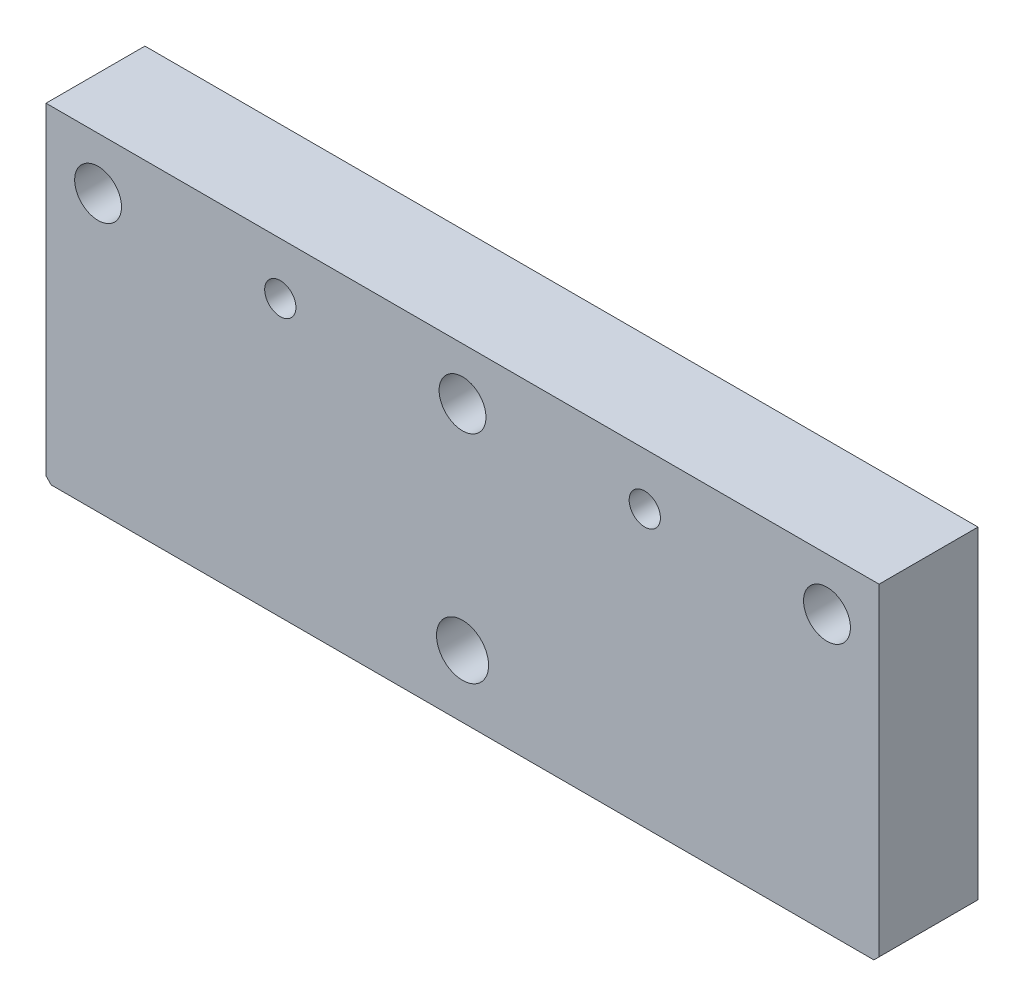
ISO-10303-21;
HEADER;
FILE_DESCRIPTION(('STEP AP214'),'2;1');
FILE_NAME('part.step','',(''),(''),'','','');
FILE_SCHEMA(('AUTOMOTIVE_DESIGN { 1 0 10303 214 1 1 1 1 }'));
ENDSEC;
DATA;
#1=APPLICATION_CONTEXT('core data for automotive mechanical design processes');
#2=APPLICATION_PROTOCOL_DEFINITION('international standard','automotive_design',2000,#1);
#3=PRODUCT_CONTEXT('',#1,'mechanical');
#4=PRODUCT('Part','Part','',(#3));
#5=PRODUCT_RELATED_PRODUCT_CATEGORY('part','',(#4));
#6=PRODUCT_DEFINITION_FORMATION('','',#4);
#7=PRODUCT_DEFINITION_CONTEXT('part definition',#1,'design');
#8=PRODUCT_DEFINITION('design','',#6,#7);
#9=PRODUCT_DEFINITION_SHAPE('','',#8);
#10=(LENGTH_UNIT() NAMED_UNIT(*) SI_UNIT(.MILLI.,.METRE.));
#11=(NAMED_UNIT(*) PLANE_ANGLE_UNIT() SI_UNIT($,.RADIAN.));
#12=(NAMED_UNIT(*) SI_UNIT($,.STERADIAN.) SOLID_ANGLE_UNIT());
#13=UNCERTAINTY_MEASURE_WITH_UNIT(LENGTH_MEASURE(1.E-05),#10,'distance_accuracy_value','');
#14=(GEOMETRIC_REPRESENTATION_CONTEXT(3) GLOBAL_UNCERTAINTY_ASSIGNED_CONTEXT((#13)) GLOBAL_UNIT_ASSIGNED_CONTEXT((#10,
#11,#12)) REPRESENTATION_CONTEXT('',''));
#15=CARTESIAN_POINT('',(0.,0.,0.));
#16=DIRECTION('',(0.,0.,1.));
#17=DIRECTION('',(1.,0.,0.));
#18=AXIS2_PLACEMENT_3D('',#15,#16,#17);
#19=CARTESIAN_POINT('',(35.,10.75,0.));
#20=DIRECTION('',(0.,0.,-1.));
#21=DIRECTION('',(-1.,0.,0.));
#22=AXIS2_PLACEMENT_3D('',#19,#20,#21);
#23=CYLINDRICAL_SURFACE('',#22,3.99999999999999);
#24=CARTESIAN_POINT('',(35.,10.75,4.4));
#25=DIRECTION('',(0.,0.,-1.));
#26=DIRECTION('',(-1.,0.,0.));
#27=AXIS2_PLACEMENT_3D('',#24,#25,#26);
#28=CIRCLE('',#27,3.99999999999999);
#29=CARTESIAN_POINT('',(31.,10.75,4.4));
#30=VERTEX_POINT('',#29);
#31=EDGE_CURVE('E19',#30,#30,#28,.F.);
#32=ORIENTED_EDGE('',*,*,#31,.T.);
#33=EDGE_LOOP('',(#32));
#34=FACE_BOUND('',#33,.T.);
#35=CARTESIAN_POINT('',(35.,10.75,0.));
#36=DIRECTION('',(0.,0.,-1.));
#37=DIRECTION('',(-1.,0.,0.));
#38=AXIS2_PLACEMENT_3D('',#35,#36,#37);
#39=CIRCLE('',#38,3.99999999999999);
#40=CARTESIAN_POINT('',(31.,10.75,0.));
#41=VERTEX_POINT('',#40);
#42=EDGE_CURVE('E162',#41,#41,#39,.T.);
#43=ORIENTED_EDGE('',*,*,#42,.T.);
#44=EDGE_LOOP('',(#43));
#45=FACE_BOUND('',#44,.T.);
#46=ADVANCED_FACE('F16',(#34,#45),#23,.F.);
#47=CARTESIAN_POINT('',(0.,10.75,0.));
#48=DIRECTION('',(0.,0.,-1.));
#49=DIRECTION('',(-1.,0.,0.));
#50=AXIS2_PLACEMENT_3D('',#47,#48,#49);
#51=CYLINDRICAL_SURFACE('',#50,3.99999999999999);
#52=CARTESIAN_POINT('',(0.,10.75,4.4));
#53=DIRECTION('',(0.,0.,-1.));
#54=DIRECTION('',(-1.,0.,0.));
#55=AXIS2_PLACEMENT_3D('',#52,#53,#54);
#56=CIRCLE('',#55,3.99999999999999);
#57=CARTESIAN_POINT('',(-3.99999999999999,10.75,4.4));
#58=VERTEX_POINT('',#57);
#59=EDGE_CURVE('E167',#58,#58,#56,.F.);
#60=ORIENTED_EDGE('',*,*,#59,.T.);
#61=EDGE_LOOP('',(#60));
#62=FACE_BOUND('',#61,.T.);
#63=CARTESIAN_POINT('',(0.,10.75,0.));
#64=DIRECTION('',(0.,0.,-1.));
#65=DIRECTION('',(-1.,0.,0.));
#66=AXIS2_PLACEMENT_3D('',#63,#64,#65);
#67=CIRCLE('',#66,3.99999999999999);
#68=CARTESIAN_POINT('',(-3.99999999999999,10.75,0.));
#69=VERTEX_POINT('',#68);
#70=EDGE_CURVE('E159',#69,#69,#67,.T.);
#71=ORIENTED_EDGE('',*,*,#70,.T.);
#72=EDGE_LOOP('',(#71));
#73=FACE_BOUND('',#72,.T.);
#74=ADVANCED_FACE('F233',(#62,#73),#51,.F.);
#75=CARTESIAN_POINT('',(-35.,10.75,0.));
#76=DIRECTION('',(0.,0.,-1.));
#77=DIRECTION('',(-1.,0.,0.));
#78=AXIS2_PLACEMENT_3D('',#75,#76,#77);
#79=CYLINDRICAL_SURFACE('',#78,3.99999999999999);
#80=CARTESIAN_POINT('',(-35.,10.75,4.4));
#81=DIRECTION('',(0.,0.,-1.));
#82=DIRECTION('',(-1.,0.,0.));
#83=AXIS2_PLACEMENT_3D('',#80,#81,#82);
#84=CIRCLE('',#83,3.99999999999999);
#85=CARTESIAN_POINT('',(-39.,10.75,4.4));
#86=VERTEX_POINT('',#85);
#87=EDGE_CURVE('E165',#86,#86,#84,.F.);
#88=ORIENTED_EDGE('',*,*,#87,.T.);
#89=EDGE_LOOP('',(#88));
#90=FACE_BOUND('',#89,.T.);
#91=CARTESIAN_POINT('',(-35.,10.75,0.));
#92=DIRECTION('',(0.,0.,-1.));
#93=DIRECTION('',(-1.,0.,0.));
#94=AXIS2_PLACEMENT_3D('',#91,#92,#93);
#95=CIRCLE('',#94,3.99999999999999);
#96=CARTESIAN_POINT('',(-39.,10.75,0.));
#97=VERTEX_POINT('',#96);
#98=EDGE_CURVE('E95',#97,#97,#95,.T.);
#99=ORIENTED_EDGE('',*,*,#98,.T.);
#100=EDGE_LOOP('',(#99));
#101=FACE_BOUND('',#100,.T.);
#102=ADVANCED_FACE('F231',(#90,#101),#79,.F.);
#103=CARTESIAN_POINT('',(-39.5,-15.75,0.499999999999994));
#104=DIRECTION('',(-0.577350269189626,-0.577350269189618,-0.577350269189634));
#105=DIRECTION('',(-0.707106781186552,0.,0.707106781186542));
#106=AXIS2_PLACEMENT_3D('',#103,#104,#105);
#107=PLANE('',#106);
#108=DIRECTION('',(0.,-0.707106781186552,0.707106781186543));
#109=VECTOR('',#108,1.);
#110=CARTESIAN_POINT('',(-39.5,-15.75,0.499999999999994));
#111=LINE('',#110,#109);
#112=CARTESIAN_POINT('',(-39.5,-15.25,0.));
#113=VERTEX_POINT('',#112);
#114=CARTESIAN_POINT('',(-39.5,-15.75,0.499999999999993));
#115=VERTEX_POINT('',#114);
#116=EDGE_CURVE('E86',#113,#115,#111,.T.);
#117=ORIENTED_EDGE('',*,*,#116,.T.);
#118=DIRECTION('',(-0.707106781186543,0.707106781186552,0.));
#119=VECTOR('',#118,1.);
#120=CARTESIAN_POINT('',(-39.5,-15.75,0.49999999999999));
#121=LINE('',#120,#119);
#122=CARTESIAN_POINT('',(-40.,-15.25,0.499999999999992));
#123=VERTEX_POINT('',#122);
#124=EDGE_CURVE('E89',#115,#123,#121,.T.);
#125=ORIENTED_EDGE('',*,*,#124,.T.);
#126=DIRECTION('',(0.707106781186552,0.,-0.707106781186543));
#127=VECTOR('',#126,1.);
#128=CARTESIAN_POINT('',(-40.,-15.25,0.499999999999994));
#129=LINE('',#128,#127);
#130=EDGE_CURVE('E83',#123,#113,#129,.T.);
#131=ORIENTED_EDGE('',*,*,#130,.T.);
#132=EDGE_LOOP('',(#117,#125,#131));
#133=FACE_BOUND('',#132,.T.);
#134=ADVANCED_FACE('F85',(#133),#107,.T.);
#135=CARTESIAN_POINT('',(40.,-15.25,0.499999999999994));
#136=DIRECTION('',(0.577350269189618,-0.577350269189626,-0.577350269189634));
#137=DIRECTION('',(0.,0.707106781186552,-0.707106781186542));
#138=AXIS2_PLACEMENT_3D('',#135,#136,#137);
#139=PLANE('',#138);
#140=DIRECTION('',(-0.707106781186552,-0.707106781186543,0.));
#141=VECTOR('',#140,1.);
#142=CARTESIAN_POINT('',(40.,-15.25,0.49999999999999));
#143=LINE('',#142,#141);
#144=CARTESIAN_POINT('',(40.,-15.25,0.499999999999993));
#145=VERTEX_POINT('',#144);
#146=CARTESIAN_POINT('',(39.5,-15.75,0.499999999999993));
#147=VERTEX_POINT('',#146);
#148=EDGE_CURVE('E423',#145,#147,#143,.T.);
#149=ORIENTED_EDGE('',*,*,#148,.T.);
#150=DIRECTION('',(0.,-0.707106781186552,0.707106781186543));
#151=VECTOR('',#150,1.);
#152=CARTESIAN_POINT('',(39.5,-15.75,0.499999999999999));
#153=LINE('',#152,#151);
#154=CARTESIAN_POINT('',(39.5,-15.25,0.));
#155=VERTEX_POINT('',#154);
#156=EDGE_CURVE('E78',#147,#155,#153,.F.);
#157=ORIENTED_EDGE('',*,*,#156,.T.);
#158=DIRECTION('',(0.707106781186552,0.,0.707106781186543));
#159=VECTOR('',#158,1.);
#160=CARTESIAN_POINT('',(40.,-15.25,0.499999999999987));
#161=LINE('',#160,#159);
#162=EDGE_CURVE('E425',#155,#145,#161,.T.);
#163=ORIENTED_EDGE('',*,*,#162,.T.);
#164=EDGE_LOOP('',(#149,#157,#163));
#165=FACE_BOUND('',#164,.T.);
#166=ADVANCED_FACE('F180',(#165),#139,.T.);
#167=CARTESIAN_POINT('',(37.25,10.75,4.4));
#168=DIRECTION('',(0.,0.,1.));
#169=DIRECTION('',(1.,0.,0.));
#170=AXIS2_PLACEMENT_3D('',#167,#168,#169);
#171=PLANE('',#170);
#172=ORIENTED_EDGE('',*,*,#31,.F.);
#173=EDGE_LOOP('',(#172));
#174=FACE_BOUND('',#173,.T.);
#175=CARTESIAN_POINT('',(35.,10.75,4.4));
#176=DIRECTION('',(0.,0.,-1.));
#177=DIRECTION('',(-1.,0.,0.));
#178=AXIS2_PLACEMENT_3D('',#175,#176,#177);
#179=CIRCLE('',#178,2.25000000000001);
#180=CARTESIAN_POINT('',(32.75,10.75,4.4));
#181=VERTEX_POINT('',#180);
#182=EDGE_CURVE('E147',#181,#181,#179,.F.);
#183=ORIENTED_EDGE('',*,*,#182,.T.);
#184=EDGE_LOOP('',(#183));
#185=FACE_BOUND('',#184,.T.);
#186=ADVANCED_FACE('F176',(#174,#185),#171,.F.);
#187=CARTESIAN_POINT('',(2.25000000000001,10.75,4.4));
#188=DIRECTION('',(0.,0.,1.));
#189=DIRECTION('',(1.,0.,0.));
#190=AXIS2_PLACEMENT_3D('',#187,#188,#189);
#191=PLANE('',#190);
#192=ORIENTED_EDGE('',*,*,#59,.F.);
#193=EDGE_LOOP('',(#192));
#194=FACE_BOUND('',#193,.T.);
#195=CARTESIAN_POINT('',(0.,10.75,4.4));
#196=DIRECTION('',(0.,0.,-1.));
#197=DIRECTION('',(-1.,0.,0.));
#198=AXIS2_PLACEMENT_3D('',#195,#196,#197);
#199=CIRCLE('',#198,2.25000000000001);
#200=CARTESIAN_POINT('',(-2.25000000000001,10.75,4.4));
#201=VERTEX_POINT('',#200);
#202=EDGE_CURVE('E144',#201,#201,#199,.F.);
#203=ORIENTED_EDGE('',*,*,#202,.T.);
#204=EDGE_LOOP('',(#203));
#205=FACE_BOUND('',#204,.T.);
#206=ADVANCED_FACE('F179',(#194,#205),#191,.F.);
#207=CARTESIAN_POINT('',(-32.75,10.75,4.4));
#208=DIRECTION('',(0.,0.,1.));
#209=DIRECTION('',(1.,0.,0.));
#210=AXIS2_PLACEMENT_3D('',#207,#208,#209);
#211=PLANE('',#210);
#212=ORIENTED_EDGE('',*,*,#87,.F.);
#213=EDGE_LOOP('',(#212));
#214=FACE_BOUND('',#213,.T.);
#215=CARTESIAN_POINT('',(-35.,10.75,4.4));
#216=DIRECTION('',(0.,0.,-1.));
#217=DIRECTION('',(-1.,0.,0.));
#218=AXIS2_PLACEMENT_3D('',#215,#216,#217);
#219=CIRCLE('',#218,2.25000000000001);
#220=CARTESIAN_POINT('',(-37.25,10.75,4.4));
#221=VERTEX_POINT('',#220);
#222=EDGE_CURVE('E141',#221,#221,#219,.F.);
#223=ORIENTED_EDGE('',*,*,#222,.T.);
#224=EDGE_LOOP('',(#223));
#225=FACE_BOUND('',#224,.T.);
#226=ADVANCED_FACE('F210',(#214,#225),#211,.F.);
#227=CARTESIAN_POINT('',(-40.,-15.75,0.));
#228=DIRECTION('',(0.,0.,1.));
#229=DIRECTION('',(1.,0.,0.));
#230=AXIS2_PLACEMENT_3D('',#227,#228,#229);
#231=PLANE('',#230);
#232=CARTESIAN_POINT('',(0.,-9.75,0.));
#233=DIRECTION('',(0.,0.,1.));
#234=DIRECTION('',(1.,0.,0.));
#235=AXIS2_PLACEMENT_3D('',#232,#233,#234);
#236=CIRCLE('',#235,2.5);
#237=CARTESIAN_POINT('',(2.5,-9.75,0.));
#238=VERTEX_POINT('',#237);
#239=EDGE_CURVE('E137',#238,#238,#236,.T.);
#240=ORIENTED_EDGE('',*,*,#239,.T.);
#241=EDGE_LOOP('',(#240));
#242=FACE_BOUND('',#241,.T.);
#243=ORIENTED_EDGE('',*,*,#98,.F.);
#244=EDGE_LOOP('',(#243));
#245=FACE_BOUND('',#244,.T.);
#246=ORIENTED_EDGE('',*,*,#70,.F.);
#247=EDGE_LOOP('',(#246));
#248=FACE_BOUND('',#247,.T.);
#249=ORIENTED_EDGE('',*,*,#42,.F.);
#250=EDGE_LOOP('',(#249));
#251=FACE_BOUND('',#250,.T.);
#252=CARTESIAN_POINT('',(-17.5,10.75,0.));
#253=DIRECTION('',(0.,0.,1.));
#254=DIRECTION('',(1.,0.,0.));
#255=AXIS2_PLACEMENT_3D('',#252,#253,#254);
#256=CIRCLE('',#255,1.5);
#257=CARTESIAN_POINT('',(-16.,10.75,0.));
#258=VERTEX_POINT('',#257);
#259=EDGE_CURVE('E150',#258,#258,#256,.T.);
#260=ORIENTED_EDGE('',*,*,#259,.T.);
#261=EDGE_LOOP('',(#260));
#262=FACE_BOUND('',#261,.T.);
#263=CARTESIAN_POINT('',(17.5,10.75,0.));
#264=DIRECTION('',(0.,0.,1.));
#265=DIRECTION('',(1.,0.,0.));
#266=AXIS2_PLACEMENT_3D('',#263,#264,#265);
#267=CIRCLE('',#266,1.5);
#268=CARTESIAN_POINT('',(19.,10.75,0.));
#269=VERTEX_POINT('',#268);
#270=EDGE_CURVE('E153',#269,#269,#267,.T.);
#271=ORIENTED_EDGE('',*,*,#270,.T.);
#272=EDGE_LOOP('',(#271));
#273=FACE_BOUND('',#272,.T.);
#274=DIRECTION('',(1.,0.,0.));
#275=VECTOR('',#274,1.);
#276=CARTESIAN_POINT('',(-40.,15.25,0.));
#277=LINE('',#276,#275);
#278=CARTESIAN_POINT('',(-39.5,15.25,0.));
#279=VERTEX_POINT('',#278);
#280=CARTESIAN_POINT('',(39.5,15.25,0.));
#281=VERTEX_POINT('',#280);
#282=EDGE_CURVE('E418',#279,#281,#277,.T.);
#283=ORIENTED_EDGE('',*,*,#282,.T.);
#284=DIRECTION('',(0.,1.,0.));
#285=VECTOR('',#284,1.);
#286=CARTESIAN_POINT('',(39.5,15.75,0.));
#287=LINE('',#286,#285);
#288=EDGE_CURVE('E110',#281,#155,#287,.F.);
#289=ORIENTED_EDGE('',*,*,#288,.T.);
#290=DIRECTION('',(1.,0.,0.));
#291=VECTOR('',#290,1.);
#292=CARTESIAN_POINT('',(-40.,-15.25,0.));
#293=LINE('',#292,#291);
#294=EDGE_CURVE('E101',#155,#113,#293,.F.);
#295=ORIENTED_EDGE('',*,*,#294,.T.);
#296=DIRECTION('',(0.,1.,0.));
#297=VECTOR('',#296,1.);
#298=CARTESIAN_POINT('',(-39.5,15.75,0.));
#299=LINE('',#298,#297);
#300=EDGE_CURVE('E94',#113,#279,#299,.T.);
#301=ORIENTED_EDGE('',*,*,#300,.T.);
#302=EDGE_LOOP('',(#283,#289,#295,#301));
#303=FACE_BOUND('',#302,.T.);
#304=ADVANCED_FACE('F107',(#242,#245,#248,#251,#262,#273,#303),#231,.F.);
#305=CARTESIAN_POINT('',(-40.,15.75,0.499999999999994));
#306=DIRECTION('',(0.707106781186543,0.,0.707106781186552));
#307=DIRECTION('',(0.707106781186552,0.,-0.707106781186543));
#308=AXIS2_PLACEMENT_3D('',#305,#306,#307);
#309=PLANE('',#308);
#310=ORIENTED_EDGE('',*,*,#300,.F.);
#311=ORIENTED_EDGE('',*,*,#130,.F.);
#312=DIRECTION('',(0.,1.,0.));
#313=VECTOR('',#312,1.);
#314=CARTESIAN_POINT('',(-40.,15.75,0.499999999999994));
#315=LINE('',#314,#313);
#316=CARTESIAN_POINT('',(-40.,15.75,0.499999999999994));
#317=VERTEX_POINT('',#316);
#318=EDGE_CURVE('E414',#123,#317,#315,.T.);
#319=ORIENTED_EDGE('',*,*,#318,.T.);
#320=DIRECTION('',(0.577350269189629,-0.577350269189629,-0.57735026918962));
#321=VECTOR('',#320,1.);
#322=CARTESIAN_POINT('',(-40.,15.75,0.499999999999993));
#323=LINE('',#322,#321);
#324=EDGE_CURVE('E114',#317,#279,#323,.T.);
#325=ORIENTED_EDGE('',*,*,#324,.T.);
#326=EDGE_LOOP('',(#310,#311,#319,#325));
#327=FACE_BOUND('',#326,.T.);
#328=ADVANCED_FACE('F112',(#327),#309,.F.);
#329=CARTESIAN_POINT('',(-40.,-15.75,0.499999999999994));
#330=DIRECTION('',(0.,0.707106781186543,0.707106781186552));
#331=DIRECTION('',(0.,-0.707106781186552,0.707106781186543));
#332=AXIS2_PLACEMENT_3D('',#329,#330,#331);
#333=PLANE('',#332);
#334=DIRECTION('',(-1.,0.,0.));
#335=VECTOR('',#334,1.);
#336=CARTESIAN_POINT('',(-40.,-15.75,0.499999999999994));
#337=LINE('',#336,#335);
#338=EDGE_CURVE('E103',#147,#115,#337,.T.);
#339=ORIENTED_EDGE('',*,*,#338,.T.);
#340=ORIENTED_EDGE('',*,*,#116,.F.);
#341=ORIENTED_EDGE('',*,*,#294,.F.);
#342=ORIENTED_EDGE('',*,*,#156,.F.);
#343=EDGE_LOOP('',(#339,#340,#341,#342));
#344=FACE_BOUND('',#343,.T.);
#345=ADVANCED_FACE('F100',(#344),#333,.F.);
#346=CARTESIAN_POINT('',(-39.5,-15.75,10.));
#347=DIRECTION('',(0.707106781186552,0.707106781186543,0.));
#348=DIRECTION('',(-0.707106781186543,0.707106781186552,0.));
#349=AXIS2_PLACEMENT_3D('',#346,#347,#348);
#350=PLANE('',#349);
#351=DIRECTION('',(0.,0.,-1.));
#352=VECTOR('',#351,1.);
#353=CARTESIAN_POINT('',(-40.,-15.25,10.));
#354=LINE('',#353,#352);
#355=CARTESIAN_POINT('',(-40.,-15.25,10.));
#356=VERTEX_POINT('',#355);
#357=EDGE_CURVE('E140',#356,#123,#354,.T.);
#358=ORIENTED_EDGE('',*,*,#357,.T.);
#359=ORIENTED_EDGE('',*,*,#124,.F.);
#360=DIRECTION('',(0.,0.,1.));
#361=VECTOR('',#360,1.);
#362=CARTESIAN_POINT('',(-39.5,-15.75,10.));
#363=LINE('',#362,#361);
#364=CARTESIAN_POINT('',(-39.5,-15.75,10.));
#365=VERTEX_POINT('',#364);
#366=EDGE_CURVE('E407',#115,#365,#363,.T.);
#367=ORIENTED_EDGE('',*,*,#366,.T.);
#368=DIRECTION('',(-0.707106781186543,0.707106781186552,0.));
#369=VECTOR('',#368,1.);
#370=CARTESIAN_POINT('',(-39.5,-15.75,10.));
#371=LINE('',#370,#369);
#372=EDGE_CURVE('E428',#356,#365,#371,.F.);
#373=ORIENTED_EDGE('',*,*,#372,.F.);
#374=EDGE_LOOP('',(#358,#359,#367,#373));
#375=FACE_BOUND('',#374,.T.);
#376=ADVANCED_FACE('F265',(#375),#350,.F.);
#377=CARTESIAN_POINT('',(40.,15.75,0.499999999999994));
#378=DIRECTION('',(-0.707106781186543,0.,0.707106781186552));
#379=DIRECTION('',(0.707106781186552,0.,0.707106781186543));
#380=AXIS2_PLACEMENT_3D('',#377,#378,#379);
#381=PLANE('',#380);
#382=DIRECTION('',(0.,-1.,0.));
#383=VECTOR('',#382,1.);
#384=CARTESIAN_POINT('',(40.,15.75,0.499999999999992));
#385=LINE('',#384,#383);
#386=CARTESIAN_POINT('',(40.,15.75,0.499999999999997));
#387=VERTEX_POINT('',#386);
#388=EDGE_CURVE('E404',#387,#145,#385,.T.);
#389=ORIENTED_EDGE('',*,*,#388,.T.);
#390=ORIENTED_EDGE('',*,*,#162,.F.);
#391=ORIENTED_EDGE('',*,*,#288,.F.);
#392=DIRECTION('',(0.57735026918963,0.577350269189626,0.577350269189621));
#393=VECTOR('',#392,1.);
#394=CARTESIAN_POINT('',(39.5,15.25,0.));
#395=LINE('',#394,#393);
#396=EDGE_CURVE('E156',#281,#387,#395,.T.);
#397=ORIENTED_EDGE('',*,*,#396,.T.);
#398=EDGE_LOOP('',(#389,#390,#391,#397));
#399=FACE_BOUND('',#398,.T.);
#400=ADVANCED_FACE('F261',(#399),#381,.F.);
#401=CARTESIAN_POINT('',(40.,-15.25,10.));
#402=DIRECTION('',(-0.707106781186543,0.707106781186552,0.));
#403=DIRECTION('',(-0.707106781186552,-0.707106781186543,0.));
#404=AXIS2_PLACEMENT_3D('',#401,#402,#403);
#405=PLANE('',#404);
#406=DIRECTION('',(0.,0.,1.));
#407=VECTOR('',#406,1.);
#408=CARTESIAN_POINT('',(39.5,-15.75,10.));
#409=LINE('',#408,#407);
#410=CARTESIAN_POINT('',(39.5,-15.75,10.));
#411=VERTEX_POINT('',#410);
#412=EDGE_CURVE('E411',#411,#147,#409,.F.);
#413=ORIENTED_EDGE('',*,*,#412,.T.);
#414=ORIENTED_EDGE('',*,*,#148,.F.);
#415=DIRECTION('',(0.,0.,1.));
#416=VECTOR('',#415,1.);
#417=CARTESIAN_POINT('',(40.,-15.25,10.));
#418=LINE('',#417,#416);
#419=CARTESIAN_POINT('',(40.,-15.25,10.));
#420=VERTEX_POINT('',#419);
#421=EDGE_CURVE('E398',#145,#420,#418,.T.);
#422=ORIENTED_EDGE('',*,*,#421,.T.);
#423=DIRECTION('',(-0.707106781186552,-0.707106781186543,0.));
#424=VECTOR('',#423,1.);
#425=CARTESIAN_POINT('',(40.,-15.25,10.));
#426=LINE('',#425,#424);
#427=EDGE_CURVE('E421',#411,#420,#426,.F.);
#428=ORIENTED_EDGE('',*,*,#427,.F.);
#429=EDGE_LOOP('',(#413,#414,#422,#428));
#430=FACE_BOUND('',#429,.T.);
#431=ADVANCED_FACE('F257',(#430),#405,.F.);
#432=CARTESIAN_POINT('',(-40.,15.75,0.499999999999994));
#433=DIRECTION('',(0.,-0.707106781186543,0.707106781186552));
#434=DIRECTION('',(0.,-0.707106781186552,-0.707106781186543));
#435=AXIS2_PLACEMENT_3D('',#432,#433,#434);
#436=PLANE('',#435);
#437=ORIENTED_EDGE('',*,*,#282,.F.);
#438=ORIENTED_EDGE('',*,*,#324,.F.);
#439=DIRECTION('',(1.,0.,0.));
#440=VECTOR('',#439,1.);
#441=CARTESIAN_POINT('',(-40.,15.75,0.499999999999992));
#442=LINE('',#441,#440);
#443=EDGE_CURVE('E392',#317,#387,#442,.T.);
#444=ORIENTED_EDGE('',*,*,#443,.T.);
#445=ORIENTED_EDGE('',*,*,#396,.F.);
#446=EDGE_LOOP('',(#437,#438,#444,#445));
#447=FACE_BOUND('',#446,.T.);
#448=ADVANCED_FACE('F205',(#447),#436,.F.);
#449=CARTESIAN_POINT('',(17.5,10.75,0.));
#450=DIRECTION('',(0.,0.,1.));
#451=DIRECTION('',(1.,0.,0.));
#452=AXIS2_PLACEMENT_3D('',#449,#450,#451);
#453=CYLINDRICAL_SURFACE('',#452,1.5);
#454=CARTESIAN_POINT('',(17.5,10.75,10.));
#455=DIRECTION('',(0.,0.,1.));
#456=DIRECTION('',(1.,0.,0.));
#457=AXIS2_PLACEMENT_3D('',#454,#455,#456);
#458=CIRCLE('',#457,1.5);
#459=CARTESIAN_POINT('',(19.,10.75,10.));
#460=VERTEX_POINT('',#459);
#461=EDGE_CURVE('E134',#460,#460,#458,.F.);
#462=ORIENTED_EDGE('',*,*,#461,.F.);
#463=EDGE_LOOP('',(#462));
#464=FACE_BOUND('',#463,.T.);
#465=ORIENTED_EDGE('',*,*,#270,.F.);
#466=EDGE_LOOP('',(#465));
#467=FACE_BOUND('',#466,.T.);
#468=ADVANCED_FACE('F202',(#464,#467),#453,.F.);
#469=CARTESIAN_POINT('',(-17.5,10.75,0.));
#470=DIRECTION('',(0.,0.,1.));
#471=DIRECTION('',(1.,0.,0.));
#472=AXIS2_PLACEMENT_3D('',#469,#470,#471);
#473=CYLINDRICAL_SURFACE('',#472,1.5);
#474=CARTESIAN_POINT('',(-17.5,10.75,10.));
#475=DIRECTION('',(0.,0.,1.));
#476=DIRECTION('',(1.,0.,0.));
#477=AXIS2_PLACEMENT_3D('',#474,#475,#476);
#478=CIRCLE('',#477,1.5);
#479=CARTESIAN_POINT('',(-16.,10.75,10.));
#480=VERTEX_POINT('',#479);
#481=EDGE_CURVE('E131',#480,#480,#478,.F.);
#482=ORIENTED_EDGE('',*,*,#481,.F.);
#483=EDGE_LOOP('',(#482));
#484=FACE_BOUND('',#483,.T.);
#485=ORIENTED_EDGE('',*,*,#259,.F.);
#486=EDGE_LOOP('',(#485));
#487=FACE_BOUND('',#486,.T.);
#488=ADVANCED_FACE('F188',(#484,#487),#473,.F.);
#489=CARTESIAN_POINT('',(35.,10.75,0.));
#490=DIRECTION('',(0.,0.,-1.));
#491=DIRECTION('',(-1.,0.,0.));
#492=AXIS2_PLACEMENT_3D('',#489,#490,#491);
#493=CYLINDRICAL_SURFACE('',#492,2.25000000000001);
#494=ORIENTED_EDGE('',*,*,#182,.F.);
#495=EDGE_LOOP('',(#494));
#496=FACE_BOUND('',#495,.T.);
#497=CARTESIAN_POINT('',(35.,10.75,10.));
#498=DIRECTION('',(0.,0.,-1.));
#499=DIRECTION('',(-1.,0.,0.));
#500=AXIS2_PLACEMENT_3D('',#497,#498,#499);
#501=CIRCLE('',#500,2.25000000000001);
#502=CARTESIAN_POINT('',(32.75,10.75,10.));
#503=VERTEX_POINT('',#502);
#504=EDGE_CURVE('E128',#503,#503,#501,.T.);
#505=ORIENTED_EDGE('',*,*,#504,.F.);
#506=EDGE_LOOP('',(#505));
#507=FACE_BOUND('',#506,.T.);
#508=ADVANCED_FACE('F184',(#496,#507),#493,.F.);
#509=CARTESIAN_POINT('',(0.,10.75,0.));
#510=DIRECTION('',(0.,0.,-1.));
#511=DIRECTION('',(-1.,0.,0.));
#512=AXIS2_PLACEMENT_3D('',#509,#510,#511);
#513=CYLINDRICAL_SURFACE('',#512,2.25000000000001);
#514=ORIENTED_EDGE('',*,*,#202,.F.);
#515=EDGE_LOOP('',(#514));
#516=FACE_BOUND('',#515,.T.);
#517=CARTESIAN_POINT('',(0.,10.75,10.));
#518=DIRECTION('',(0.,0.,-1.));
#519=DIRECTION('',(-1.,0.,0.));
#520=AXIS2_PLACEMENT_3D('',#517,#518,#519);
#521=CIRCLE('',#520,2.25000000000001);
#522=CARTESIAN_POINT('',(-2.25000000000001,10.75,10.));
#523=VERTEX_POINT('',#522);
#524=EDGE_CURVE('E125',#523,#523,#521,.T.);
#525=ORIENTED_EDGE('',*,*,#524,.F.);
#526=EDGE_LOOP('',(#525));
#527=FACE_BOUND('',#526,.T.);
#528=ADVANCED_FACE('F187',(#516,#527),#513,.F.);
#529=CARTESIAN_POINT('',(-35.,10.75,0.));
#530=DIRECTION('',(0.,0.,-1.));
#531=DIRECTION('',(-1.,0.,0.));
#532=AXIS2_PLACEMENT_3D('',#529,#530,#531);
#533=CYLINDRICAL_SURFACE('',#532,2.25000000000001);
#534=ORIENTED_EDGE('',*,*,#222,.F.);
#535=EDGE_LOOP('',(#534));
#536=FACE_BOUND('',#535,.T.);
#537=CARTESIAN_POINT('',(-35.,10.75,10.));
#538=DIRECTION('',(0.,0.,-1.));
#539=DIRECTION('',(-1.,0.,0.));
#540=AXIS2_PLACEMENT_3D('',#537,#538,#539);
#541=CIRCLE('',#540,2.25000000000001);
#542=CARTESIAN_POINT('',(-37.25,10.75,10.));
#543=VERTEX_POINT('',#542);
#544=EDGE_CURVE('E122',#543,#543,#541,.T.);
#545=ORIENTED_EDGE('',*,*,#544,.F.);
#546=EDGE_LOOP('',(#545));
#547=FACE_BOUND('',#546,.T.);
#548=ADVANCED_FACE('F318',(#536,#547),#533,.F.);
#549=CARTESIAN_POINT('',(0.,-9.75,10.));
#550=DIRECTION('',(0.,0.,1.));
#551=DIRECTION('',(1.,0.,0.));
#552=AXIS2_PLACEMENT_3D('',#549,#550,#551);
#553=CYLINDRICAL_SURFACE('',#552,2.5);
#554=CARTESIAN_POINT('',(0.,-9.75,10.));
#555=DIRECTION('',(0.,0.,1.));
#556=DIRECTION('',(1.,0.,0.));
#557=AXIS2_PLACEMENT_3D('',#554,#555,#556);
#558=CIRCLE('',#557,2.5);
#559=CARTESIAN_POINT('',(2.5,-9.75,10.));
#560=VERTEX_POINT('',#559);
#561=EDGE_CURVE('E118',#560,#560,#558,.F.);
#562=ORIENTED_EDGE('',*,*,#561,.F.);
#563=EDGE_LOOP('',(#562));
#564=FACE_BOUND('',#563,.T.);
#565=ORIENTED_EDGE('',*,*,#239,.F.);
#566=EDGE_LOOP('',(#565));
#567=FACE_BOUND('',#566,.T.);
#568=ADVANCED_FACE('F327',(#564,#567),#553,.F.);
#569=CARTESIAN_POINT('',(-40.,15.75,10.));
#570=DIRECTION('',(1.,0.,0.));
#571=DIRECTION('',(0.,0.,-1.));
#572=AXIS2_PLACEMENT_3D('',#569,#570,#571);
#573=PLANE('',#572);
#574=ORIENTED_EDGE('',*,*,#357,.F.);
#575=DIRECTION('',(0.,1.,0.));
#576=VECTOR('',#575,1.);
#577=CARTESIAN_POINT('',(-40.,-15.75,10.));
#578=LINE('',#577,#576);
#579=CARTESIAN_POINT('',(-40.,15.75,10.));
#580=VERTEX_POINT('',#579);
#581=EDGE_CURVE('E121',#580,#356,#578,.F.);
#582=ORIENTED_EDGE('',*,*,#581,.F.);
#583=DIRECTION('',(0.,0.,1.));
#584=VECTOR('',#583,1.);
#585=CARTESIAN_POINT('',(-40.,15.75,10.));
#586=LINE('',#585,#584);
#587=EDGE_CURVE('E394',#580,#317,#586,.F.);
#588=ORIENTED_EDGE('',*,*,#587,.T.);
#589=ORIENTED_EDGE('',*,*,#318,.F.);
#590=EDGE_LOOP('',(#574,#582,#588,#589));
#591=FACE_BOUND('',#590,.T.);
#592=ADVANCED_FACE('F338',(#591),#573,.F.);
#593=CARTESIAN_POINT('',(-40.,-15.75,10.));
#594=DIRECTION('',(0.,1.,0.));
#595=DIRECTION('',(-1.,0.,0.));
#596=AXIS2_PLACEMENT_3D('',#593,#594,#595);
#597=PLANE('',#596);
#598=ORIENTED_EDGE('',*,*,#366,.F.);
#599=ORIENTED_EDGE('',*,*,#338,.F.);
#600=ORIENTED_EDGE('',*,*,#412,.F.);
#601=DIRECTION('',(1.,0.,0.));
#602=VECTOR('',#601,1.);
#603=CARTESIAN_POINT('',(-40.,-15.75,10.));
#604=LINE('',#603,#602);
#605=EDGE_CURVE('E436',#365,#411,#604,.T.);
#606=ORIENTED_EDGE('',*,*,#605,.F.);
#607=EDGE_LOOP('',(#598,#599,#600,#606));
#608=FACE_BOUND('',#607,.T.);
#609=ADVANCED_FACE('F349',(#608),#597,.F.);
#610=CARTESIAN_POINT('',(40.,15.75,10.));
#611=DIRECTION('',(-1.,0.,0.));
#612=DIRECTION('',(0.,-1.,0.));
#613=AXIS2_PLACEMENT_3D('',#610,#611,#612);
#614=PLANE('',#613);
#615=ORIENTED_EDGE('',*,*,#421,.F.);
#616=ORIENTED_EDGE('',*,*,#388,.F.);
#617=DIRECTION('',(0.,0.,1.));
#618=VECTOR('',#617,1.);
#619=CARTESIAN_POINT('',(40.,15.75,10.));
#620=LINE('',#619,#618);
#621=CARTESIAN_POINT('',(40.,15.75,10.));
#622=VERTEX_POINT('',#621);
#623=EDGE_CURVE('E34',#387,#622,#620,.T.);
#624=ORIENTED_EDGE('',*,*,#623,.T.);
#625=DIRECTION('',(0.,1.,0.));
#626=VECTOR('',#625,1.);
#627=CARTESIAN_POINT('',(40.,-15.75,10.));
#628=LINE('',#627,#626);
#629=EDGE_CURVE('E25',#420,#622,#628,.T.);
#630=ORIENTED_EDGE('',*,*,#629,.F.);
#631=EDGE_LOOP('',(#615,#616,#624,#630));
#632=FACE_BOUND('',#631,.T.);
#633=ADVANCED_FACE('F359',(#632),#614,.F.);
#634=CARTESIAN_POINT('',(-40.,15.75,10.));
#635=DIRECTION('',(0.,-1.,0.));
#636=DIRECTION('',(1.,0.,0.));
#637=AXIS2_PLACEMENT_3D('',#634,#635,#636);
#638=PLANE('',#637);
#639=ORIENTED_EDGE('',*,*,#443,.F.);
#640=ORIENTED_EDGE('',*,*,#587,.F.);
#641=DIRECTION('',(1.,0.,0.));
#642=VECTOR('',#641,1.);
#643=CARTESIAN_POINT('',(-40.,15.75,10.));
#644=LINE('',#643,#642);
#645=EDGE_CURVE('E11',#622,#580,#644,.F.);
#646=ORIENTED_EDGE('',*,*,#645,.F.);
#647=ORIENTED_EDGE('',*,*,#623,.F.);
#648=EDGE_LOOP('',(#639,#640,#646,#647));
#649=FACE_BOUND('',#648,.T.);
#650=ADVANCED_FACE('F195',(#649),#638,.F.);
#651=CARTESIAN_POINT('',(-40.,-15.75,10.));
#652=DIRECTION('',(0.,0.,1.));
#653=DIRECTION('',(1.,0.,0.));
#654=AXIS2_PLACEMENT_3D('',#651,#652,#653);
#655=PLANE('',#654);
#656=ORIENTED_EDGE('',*,*,#629,.T.);
#657=ORIENTED_EDGE('',*,*,#645,.T.);
#658=ORIENTED_EDGE('',*,*,#581,.T.);
#659=ORIENTED_EDGE('',*,*,#372,.T.);
#660=ORIENTED_EDGE('',*,*,#605,.T.);
#661=ORIENTED_EDGE('',*,*,#427,.T.);
#662=EDGE_LOOP('',(#656,#657,#658,#659,#660,#661));
#663=FACE_BOUND('',#662,.T.);
#664=ORIENTED_EDGE('',*,*,#561,.T.);
#665=EDGE_LOOP('',(#664));
#666=FACE_BOUND('',#665,.T.);
#667=ORIENTED_EDGE('',*,*,#544,.T.);
#668=EDGE_LOOP('',(#667));
#669=FACE_BOUND('',#668,.T.);
#670=ORIENTED_EDGE('',*,*,#524,.T.);
#671=EDGE_LOOP('',(#670));
#672=FACE_BOUND('',#671,.T.);
#673=ORIENTED_EDGE('',*,*,#504,.T.);
#674=EDGE_LOOP('',(#673));
#675=FACE_BOUND('',#674,.T.);
#676=ORIENTED_EDGE('',*,*,#481,.T.);
#677=EDGE_LOOP('',(#676));
#678=FACE_BOUND('',#677,.T.);
#679=ORIENTED_EDGE('',*,*,#461,.T.);
#680=EDGE_LOOP('',(#679));
#681=FACE_BOUND('',#680,.T.);
#682=ADVANCED_FACE('F192',(#663,#666,#669,#672,#675,#678,#681),#655,.T.);
#683=CLOSED_SHELL('',(#46,#74,#102,#134,#166,#186,#206,#226,#304,#328,#345,#376,#400,#431,#448,
#468,#488,#508,#528,#548,#568,#592,#609,#633,#650,#682));
#684=MANIFOLD_SOLID_BREP('B1',#683);
#685=ADVANCED_BREP_SHAPE_REPRESENTATION('',(#18,#684),#14);
#686=SHAPE_DEFINITION_REPRESENTATION(#9,#685);
ENDSEC;
END-ISO-10303-21;
